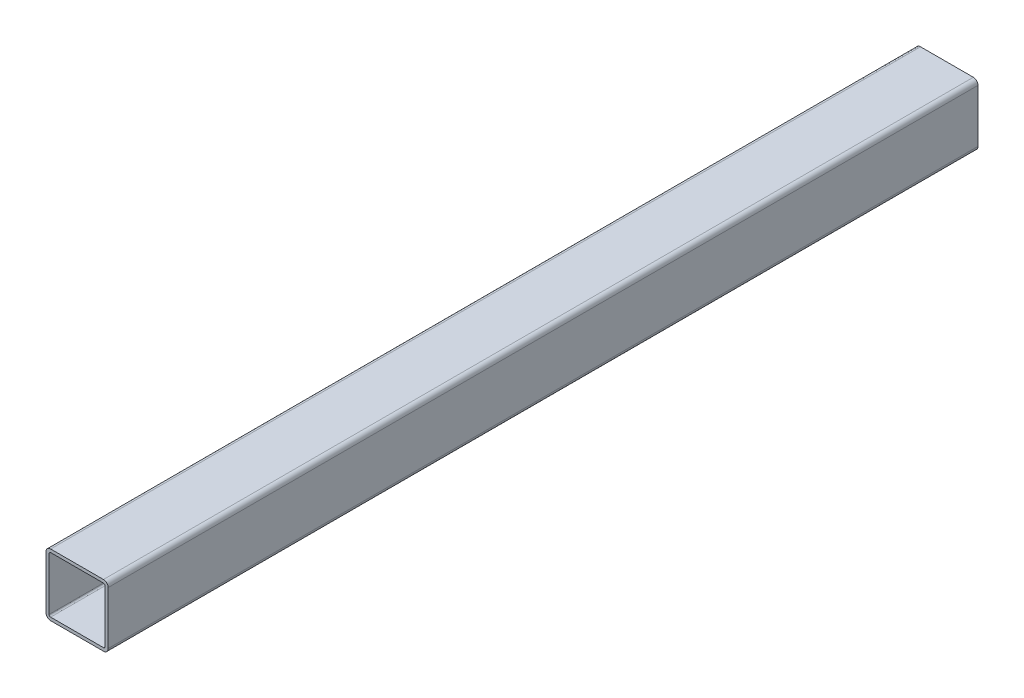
from build123d import *

# Parameters (mm, degrees)
EXTRUSION1_DEPTH = 560


with BuildPart() as part:
    # Esquisse1 → Extrusion1 (new body)
    with BuildSketch(Plane.XY):
        with BuildLine():
            Line((3, 0), (37, 0))
            ThreePointArc((37, 0), (39.121320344, 0.878679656), (40, 3))
            Line((40, 3), (40, 37))
            ThreePointArc((40, 37), (39.121320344, 39.121320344), (37, 40))
            Line((37, 40), (3, 40))
            ThreePointArc((3, 40), (0.878679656, 39.121320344), (0, 37))
            Line((0, 37), (0, 3))
            ThreePointArc((0, 3), (0.878679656, 0.878679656), (3, 0))
        make_face()
        with BuildLine():
            Line((3, 2), (37, 2))
            ThreePointArc((37, 2), (37.707106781, 2.292893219), (38, 3))
            Line((38, 3), (38, 37))
            ThreePointArc((38, 37), (37.707106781, 37.707106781), (37, 38))
            Line((37, 38), (3, 38))
            ThreePointArc((3, 38), (2.292893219, 37.707106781), (2, 37))
            Line((2, 37), (2, 3))
            ThreePointArc((2, 3), (2.292893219, 2.292893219), (3, 2))
        make_face(mode=Mode.SUBTRACT)
    extrude(amount=EXTRUSION1_DEPTH)


solid = part.part
